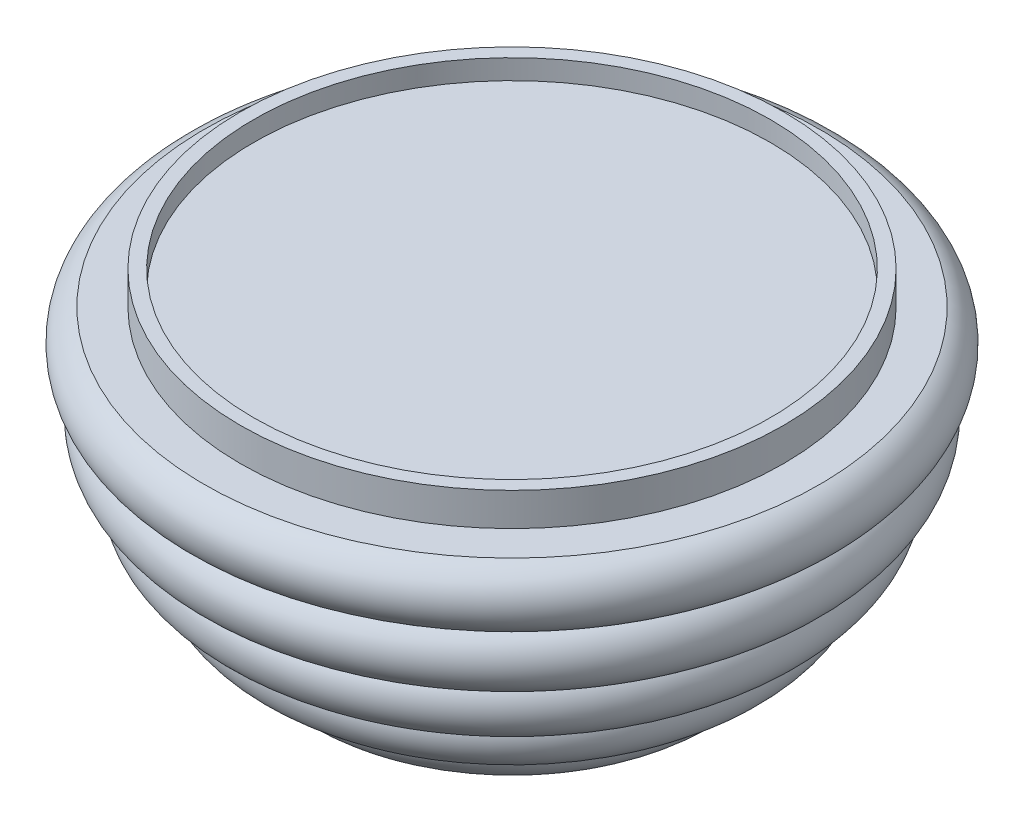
ISO-10303-21;
HEADER;
FILE_DESCRIPTION(('STEP AP214'),'2;1');
FILE_NAME('part.step','',(''),(''),'','','');
FILE_SCHEMA(('AUTOMOTIVE_DESIGN { 1 0 10303 214 1 1 1 1 }'));
ENDSEC;
DATA;
#1=APPLICATION_CONTEXT('core data for automotive mechanical design processes');
#2=APPLICATION_PROTOCOL_DEFINITION('international standard','automotive_design',2000,#1);
#3=PRODUCT_CONTEXT('',#1,'mechanical');
#4=PRODUCT('Part','Part','',(#3));
#5=PRODUCT_RELATED_PRODUCT_CATEGORY('part','',(#4));
#6=PRODUCT_DEFINITION_FORMATION('','',#4);
#7=PRODUCT_DEFINITION_CONTEXT('part definition',#1,'design');
#8=PRODUCT_DEFINITION('design','',#6,#7);
#9=PRODUCT_DEFINITION_SHAPE('','',#8);
#10=(LENGTH_UNIT() NAMED_UNIT(*) SI_UNIT(.MILLI.,.METRE.));
#11=(NAMED_UNIT(*) PLANE_ANGLE_UNIT() SI_UNIT($,.RADIAN.));
#12=(NAMED_UNIT(*) SI_UNIT($,.STERADIAN.) SOLID_ANGLE_UNIT());
#13=UNCERTAINTY_MEASURE_WITH_UNIT(LENGTH_MEASURE(1.E-05),#10,'distance_accuracy_value','');
#14=(GEOMETRIC_REPRESENTATION_CONTEXT(3) GLOBAL_UNCERTAINTY_ASSIGNED_CONTEXT((#13)) GLOBAL_UNIT_ASSIGNED_CONTEXT((#10,
#11,#12)) REPRESENTATION_CONTEXT('',''));
#15=CARTESIAN_POINT('',(0.,0.,0.));
#16=DIRECTION('',(0.,0.,1.));
#17=DIRECTION('',(1.,0.,0.));
#18=AXIS2_PLACEMENT_3D('',#15,#16,#17);
#19=CARTESIAN_POINT('',(0.451210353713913,-2.80081885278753,107.177128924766));
#20=DIRECTION('',(0.,-1.,0.));
#21=DIRECTION('',(0.,0.,-1.));
#22=AXIS2_PLACEMENT_3D('',#19,#20,#21);
#23=CYLINDRICAL_SURFACE('',#22,41.);
#24=CARTESIAN_POINT('',(0.451210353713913,-2.80081885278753,107.177128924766));
#25=DIRECTION('',(0.,1.,0.));
#26=DIRECTION('',(0.,0.,1.));
#27=AXIS2_PLACEMENT_3D('',#24,#25,#26);
#28=CIRCLE('',#27,41.);
#29=CARTESIAN_POINT('',(0.451210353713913,-2.80081885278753,148.177128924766));
#30=VERTEX_POINT('',#29);
#31=EDGE_CURVE('P0_E10',#30,#30,#28,.T.);
#32=ORIENTED_EDGE('',*,*,#31,.F.);
#33=EDGE_LOOP('',(#32));
#34=FACE_BOUND('',#33,.T.);
#35=CARTESIAN_POINT('',(0.451210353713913,-7.80081885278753,107.177128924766));
#36=DIRECTION('',(0.,1.,0.));
#37=DIRECTION('',(0.,0.,1.));
#38=AXIS2_PLACEMENT_3D('',#35,#36,#37);
#39=CIRCLE('',#38,41.);
#40=CARTESIAN_POINT('',(0.451210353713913,-7.80081885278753,148.177128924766));
#41=VERTEX_POINT('',#40);
#42=EDGE_CURVE('P0_E18',#41,#41,#39,.T.);
#43=ORIENTED_EDGE('',*,*,#42,.T.);
#44=EDGE_LOOP('',(#43));
#45=FACE_BOUND('',#44,.T.);
#46=ADVANCED_FACE('P0_F15',(#34,#45),#23,.T.);
#47=CARTESIAN_POINT('',(0.451210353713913,-2.80081885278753,107.177128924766));
#48=DIRECTION('',(0.,1.,0.));
#49=DIRECTION('',(0.,0.,1.));
#50=AXIS2_PLACEMENT_3D('',#47,#48,#49);
#51=PLANE('',#50);
#52=CARTESIAN_POINT('',(0.451210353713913,-2.80081885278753,107.177128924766));
#53=DIRECTION('',(0.,1.,0.));
#54=DIRECTION('',(0.,0.,1.));
#55=AXIS2_PLACEMENT_3D('',#52,#53,#54);
#56=CIRCLE('',#55,39.);
#57=CARTESIAN_POINT('',(0.451210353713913,-2.80081885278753,146.177128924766));
#58=VERTEX_POINT('',#57);
#59=EDGE_CURVE('P0_E25',#58,#58,#56,.T.);
#60=ORIENTED_EDGE('',*,*,#59,.F.);
#61=EDGE_LOOP('',(#60));
#62=FACE_BOUND('',#61,.T.);
#63=ORIENTED_EDGE('',*,*,#31,.T.);
#64=EDGE_LOOP('',(#63));
#65=FACE_BOUND('',#64,.T.);
#66=ADVANCED_FACE('P0_F46',(#62,#65),#51,.T.);
#67=CARTESIAN_POINT('',(0.451210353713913,-7.80081885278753,107.177128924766));
#68=DIRECTION('',(0.,1.,0.));
#69=DIRECTION('',(0.,0.,1.));
#70=AXIS2_PLACEMENT_3D('',#67,#68,#69);
#71=PLANE('',#70);
#72=ORIENTED_EDGE('',*,*,#42,.F.);
#73=EDGE_LOOP('',(#72));
#74=FACE_BOUND('',#73,.T.);
#75=ADVANCED_FACE('P0_F37',(#74),#71,.F.);
#76=CARTESIAN_POINT('',(0.451210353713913,-2.80081885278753,107.177128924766));
#77=DIRECTION('',(0.,-1.,0.));
#78=DIRECTION('',(0.,0.,-1.));
#79=AXIS2_PLACEMENT_3D('',#76,#77,#78);
#80=CYLINDRICAL_SURFACE('',#79,39.);
#81=ORIENTED_EDGE('',*,*,#59,.T.);
#82=EDGE_LOOP('',(#81));
#83=FACE_BOUND('',#82,.T.);
#84=CARTESIAN_POINT('',(0.451210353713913,-5.80081885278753,107.177128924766));
#85=DIRECTION('',(0.,1.,0.));
#86=DIRECTION('',(0.,0.,1.));
#87=AXIS2_PLACEMENT_3D('',#84,#85,#86);
#88=CIRCLE('',#87,39.);
#89=CARTESIAN_POINT('',(0.451210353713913,-5.80081885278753,146.177128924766));
#90=VERTEX_POINT('',#89);
#91=EDGE_CURVE('P0_E29',#90,#90,#88,.T.);
#92=ORIENTED_EDGE('',*,*,#91,.F.);
#93=EDGE_LOOP('',(#92));
#94=FACE_BOUND('',#93,.T.);
#95=ADVANCED_FACE('P0_F35',(#83,#94),#80,.F.);
#96=CARTESIAN_POINT('',(0.451210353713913,-5.80081885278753,107.177128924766));
#97=DIRECTION('',(0.,1.,0.));
#98=DIRECTION('',(0.,0.,1.));
#99=AXIS2_PLACEMENT_3D('',#96,#97,#98);
#100=PLANE('',#99);
#101=ORIENTED_EDGE('',*,*,#91,.T.);
#102=EDGE_LOOP('',(#101));
#103=FACE_BOUND('',#102,.T.);
#104=ADVANCED_FACE('P0_F33',(#103),#100,.T.);
#105=CLOSED_SHELL('',(#46,#66,#75,#95,#104));
#106=MANIFOLD_SOLID_BREP('P0_B1',#105);
#107=CARTESIAN_POINT('',(0.451210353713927,-52.8008188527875,107.177128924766));
#108=DIRECTION('',(0.,1.,0.));
#109=DIRECTION('',(-0.995644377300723,0.,-0.093232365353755));
#110=AXIS2_PLACEMENT_3D('',#107,#108,#109);
#111=SPHERICAL_SURFACE('',#110,5.);
#112=CARTESIAN_POINT('',(0.451210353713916,-53.9952712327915,107.177128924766));
#113=DIRECTION('',(0.,1.,0.));
#114=DIRECTION('',(-0.093232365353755,0.,0.995644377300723));
#115=AXIS2_PLACEMENT_3D('',#112,#113,#114);
#116=CIRCLE('',#115,4.85523259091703);
#117=CARTESIAN_POINT('',(-0.0014544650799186,-53.9952712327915,112.0112139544));
#118=VERTEX_POINT('',#117);
#119=EDGE_CURVE('P1_E39',#118,#118,#116,.T.);
#120=ORIENTED_EDGE('',*,*,#119,.F.);
#121=EDGE_LOOP('',(#120));
#122=FACE_BOUND('',#121,.T.);
#123=ADVANCED_FACE('P1_F14',(#122),#111,.T.);
#124=CARTESIAN_POINT('',(0.451210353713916,-12.5045996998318,107.177128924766));
#125=DIRECTION('',(0.,1.,0.));
#126=DIRECTION('',(-0.093232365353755,0.,0.995644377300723));
#127=AXIS2_PLACEMENT_3D('',#124,#125,#126);
#128=TOROIDAL_SURFACE('',#127,44.7534852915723,5.);
#129=CARTESIAN_POINT('',(0.451210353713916,-17.4580890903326,107.177128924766));
#130=DIRECTION('',(0.,1.,0.));
#131=DIRECTION('',(-0.093232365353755,0.,0.995644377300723));
#132=AXIS2_PLACEMENT_3D('',#129,#130,#131);
#133=CIRCLE('',#132,45.4338843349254);
#134=CARTESIAN_POINT('',(-3.7846981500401,-17.4580890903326,152.413120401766));
#135=VERTEX_POINT('',#134);
#136=EDGE_CURVE('P1_E9',#135,#135,#133,.T.);
#137=ORIENTED_EDGE('',*,*,#136,.T.);
#138=EDGE_LOOP('',(#137));
#139=FACE_BOUND('',#138,.T.);
#140=CARTESIAN_POINT('',(0.451210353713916,-7.80081885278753,107.177128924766));
#141=DIRECTION('',(0.,-1.,0.));
#142=DIRECTION('',(0.093232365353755,0.,-0.995644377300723));
#143=AXIS2_PLACEMENT_3D('',#140,#141,#142);
#144=CIRCLE('',#143,46.4489043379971);
#145=CARTESIAN_POINT('',(4.78175157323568,-7.80081885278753,60.9305384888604));
#146=VERTEX_POINT('',#145);
#147=EDGE_CURVE('P1_E42',#146,#146,#144,.F.);
#148=ORIENTED_EDGE('',*,*,#147,.F.);
#149=EDGE_LOOP('',(#148));
#150=FACE_BOUND('',#149,.T.);
#151=ADVANCED_FACE('P1_F85',(#139,#150),#128,.T.);
#152=CARTESIAN_POINT('',(0.451210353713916,-21.70658359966,107.177128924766));
#153=DIRECTION('',(0.,1.,0.));
#154=DIRECTION('',(-0.093232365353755,0.,0.995644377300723));
#155=AXIS2_PLACEMENT_3D('',#152,#153,#154);
#156=TOROIDAL_SURFACE('',#155,42.797543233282,4.99999999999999);
#157=CARTESIAN_POINT('',(0.451210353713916,-26.6932902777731,107.177128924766));
#158=DIRECTION('',(0.,1.,0.));
#159=DIRECTION('',(-0.093232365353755,0.,0.995644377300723));
#160=AXIS2_PLACEMENT_3D('',#157,#158,#159);
#161=CIRCLE('',#160,42.4331855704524);
#162=CARTESIAN_POINT('',(-3.50493590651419,-26.6932902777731,149.425491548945));
#163=VERTEX_POINT('',#162);
#164=EDGE_CURVE('P1_E20',#163,#163,#161,.T.);
#165=ORIENTED_EDGE('',*,*,#164,.T.);
#166=EDGE_LOOP('',(#165));
#167=FACE_BOUND('',#166,.T.);
#168=ORIENTED_EDGE('',*,*,#136,.F.);
#169=EDGE_LOOP('',(#168));
#170=FACE_BOUND('',#169,.T.);
#171=ADVANCED_FACE('P1_F87',(#167,#170),#156,.T.);
#172=CARTESIAN_POINT('',(0.451210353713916,-30.3008188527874,107.177128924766));
#173=DIRECTION('',(0.,1.,0.));
#174=DIRECTION('',(-0.093232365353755,0.,0.995644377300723));
#175=AXIS2_PLACEMENT_3D('',#172,#173,#174);
#176=TOROIDAL_SURFACE('',#175,38.9711431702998,4.99999999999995);
#177=CARTESIAN_POINT('',(0.451210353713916,-35.1027998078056,107.177128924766));
#178=DIRECTION('',(0.,1.,0.));
#179=DIRECTION('',(-0.093232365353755,0.,0.995644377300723));
#180=AXIS2_PLACEMENT_3D('',#177,#178,#179);
#181=CIRCLE('',#180,37.5779529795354);
#182=CARTESIAN_POINT('',(-3.05227108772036,-35.1027998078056,144.591406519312));
#183=VERTEX_POINT('',#182);
#184=EDGE_CURVE('P1_E24',#183,#183,#181,.T.);
#185=ORIENTED_EDGE('',*,*,#184,.T.);
#186=EDGE_LOOP('',(#185));
#187=FACE_BOUND('',#186,.T.);
#188=ORIENTED_EDGE('',*,*,#164,.F.);
#189=EDGE_LOOP('',(#188));
#190=FACE_BOUND('',#189,.T.);
#191=ADVANCED_FACE('P1_F93',(#187,#190),#176,.T.);
#192=CARTESIAN_POINT('',(0.451210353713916,-37.9116961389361,107.177128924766));
#193=DIRECTION('',(0.,1.,0.));
#194=DIRECTION('',(-0.093232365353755,0.,0.995644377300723));
#195=AXIS2_PLACEMENT_3D('',#192,#193,#194);
#196=TOROIDAL_SURFACE('',#195,33.4415171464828,4.99999999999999);
#197=CARTESIAN_POINT('',(0.451210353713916,-42.3190817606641,107.177128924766));
#198=DIRECTION('',(0.,1.,0.));
#199=DIRECTION('',(-0.093232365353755,0.,0.995644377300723));
#200=AXIS2_PLACEMENT_3D('',#197,#198,#199);
#201=CIRCLE('',#200,31.0803835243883);
#202=CARTESIAN_POINT('',(-2.44648731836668,-42.3190817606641,138.122138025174));
#203=VERTEX_POINT('',#202);
#204=EDGE_CURVE('P1_E28',#203,#203,#201,.T.);
#205=ORIENTED_EDGE('',*,*,#204,.T.);
#206=EDGE_LOOP('',(#205));
#207=FACE_BOUND('',#206,.T.);
#208=ORIENTED_EDGE('',*,*,#184,.F.);
#209=EDGE_LOOP('',(#208));
#210=FACE_BOUND('',#209,.T.);
#211=ADVANCED_FACE('P1_F99',(#207,#210),#196,.T.);
#212=CARTESIAN_POINT('',(0.451210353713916,-44.2065835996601,107.177128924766));
#213=DIRECTION('',(0.,1.,0.));
#214=DIRECTION('',(-0.093232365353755,0.,0.995644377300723));
#215=AXIS2_PLACEMENT_3D('',#212,#213,#214);
#216=TOROIDAL_SURFACE('',#215,26.4503363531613,5.);
#217=CARTESIAN_POINT('',(0.451210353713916,-48.0267499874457,107.177128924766));
#218=DIRECTION('',(0.,1.,0.));
#219=DIRECTION('',(-0.093232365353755,0.,0.995644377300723));
#220=AXIS2_PLACEMENT_3D('',#217,#218,#219);
#221=CIRCLE('',#220,23.2244521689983);
#222=CARTESIAN_POINT('',(-1.71406025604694,-48.0267499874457,130.300424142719));
#223=VERTEX_POINT('',#222);
#224=EDGE_CURVE('P1_E33',#223,#223,#221,.T.);
#225=ORIENTED_EDGE('',*,*,#224,.T.);
#226=EDGE_LOOP('',(#225));
#227=FACE_BOUND('',#226,.T.);
#228=ORIENTED_EDGE('',*,*,#204,.F.);
#229=EDGE_LOOP('',(#228));
#230=FACE_BOUND('',#229,.T.);
#231=ADVANCED_FACE('P1_F103',(#227,#230),#216,.T.);
#232=CARTESIAN_POINT('',(0.451210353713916,-48.9103644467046,107.177128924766));
#233=DIRECTION('',(0.,1.,0.));
#234=DIRECTION('',(-0.093232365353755,0.,0.995644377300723));
#235=AXIS2_PLACEMENT_3D('',#232,#233,#234);
#236=TOROIDAL_SURFACE('',#235,18.303148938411,5.);
#237=CARTESIAN_POINT('',(0.451210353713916,-51.9763519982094,107.177128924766));
#238=DIRECTION('',(0.,1.,0.));
#239=DIRECTION('',(-0.093232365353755,0.,0.995644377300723));
#240=AXIS2_PLACEMENT_3D('',#237,#238,#239);
#241=CIRCLE('',#240,14.3535008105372);
#242=CARTESIAN_POINT('',(-0.887000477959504,-51.9763519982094,121.468111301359));
#243=VERTEX_POINT('',#242);
#244=EDGE_CURVE('P1_E36',#243,#243,#241,.T.);
#245=ORIENTED_EDGE('',*,*,#244,.T.);
#246=EDGE_LOOP('',(#245));
#247=FACE_BOUND('',#246,.T.);
#248=ORIENTED_EDGE('',*,*,#224,.F.);
#249=EDGE_LOOP('',(#248));
#250=FACE_BOUND('',#249,.T.);
#251=ADVANCED_FACE('P1_F107',(#247,#250),#236,.T.);
#252=CARTESIAN_POINT('',(0.451210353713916,-51.8174608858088,107.177128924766));
#253=DIRECTION('',(0.,1.,0.));
#254=DIRECTION('',(-0.093232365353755,0.,0.995644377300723));
#255=AXIS2_PLACEMENT_3D('',#252,#253,#254);
#256=TOROIDAL_SURFACE('',#255,9.35602608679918,5.);
#257=ORIENTED_EDGE('',*,*,#119,.T.);
#258=EDGE_LOOP('',(#257));
#259=FACE_BOUND('',#258,.T.);
#260=ORIENTED_EDGE('',*,*,#244,.F.);
#261=EDGE_LOOP('',(#260));
#262=FACE_BOUND('',#261,.T.);
#263=ADVANCED_FACE('P1_F81',(#259,#262),#256,.T.);
#264=CARTESIAN_POINT('',(-53.7574229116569,-7.80081885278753,21.7510460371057));
#265=DIRECTION('',(0.,-1.,0.));
#266=DIRECTION('',(0.093232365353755,0.,-0.995644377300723));
#267=AXIS2_PLACEMENT_3D('',#264,#265,#266);
#268=PLANE('',#267);
#269=CARTESIAN_POINT('',(0.451210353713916,-7.80081885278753,107.177128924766));
#270=DIRECTION('',(0.,1.,0.));
#271=DIRECTION('',(-0.093232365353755,0.,0.995644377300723));
#272=AXIS2_PLACEMENT_3D('',#269,#270,#271);
#273=CIRCLE('',#272,12.5);
#274=CARTESIAN_POINT('',(-0.714194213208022,-7.80081885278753,119.622683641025));
#275=VERTEX_POINT('',#274);
#276=EDGE_CURVE('P1_E46',#275,#275,#273,.T.);
#277=ORIENTED_EDGE('',*,*,#276,.F.);
#278=EDGE_LOOP('',(#277));
#279=FACE_BOUND('',#278,.T.);
#280=ORIENTED_EDGE('',*,*,#147,.T.);
#281=EDGE_LOOP('',(#280));
#282=FACE_BOUND('',#281,.T.);
#283=ADVANCED_FACE('P1_F75',(#279,#282),#268,.F.);
#284=CARTESIAN_POINT('',(0.451210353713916,-10.8008188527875,107.177128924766));
#285=DIRECTION('',(0.,1.,0.));
#286=DIRECTION('',(-0.093232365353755,0.,0.995644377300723));
#287=AXIS2_PLACEMENT_3D('',#284,#285,#286);
#288=CYLINDRICAL_SURFACE('',#287,12.5);
#289=CARTESIAN_POINT('',(0.451210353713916,-10.8008188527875,107.177128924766));
#290=DIRECTION('',(0.,1.,0.));
#291=DIRECTION('',(-0.093232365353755,0.,0.995644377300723));
#292=AXIS2_PLACEMENT_3D('',#289,#290,#291);
#293=CIRCLE('',#292,12.5);
#294=CARTESIAN_POINT('',(-0.714194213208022,-10.8008188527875,119.622683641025));
#295=VERTEX_POINT('',#294);
#296=EDGE_CURVE('P1_E45',#295,#295,#293,.T.);
#297=ORIENTED_EDGE('',*,*,#296,.F.);
#298=EDGE_LOOP('',(#297));
#299=FACE_BOUND('',#298,.T.);
#300=ORIENTED_EDGE('',*,*,#276,.T.);
#301=EDGE_LOOP('',(#300));
#302=FACE_BOUND('',#301,.T.);
#303=ADVANCED_FACE('P1_F69',(#299,#302),#288,.F.);
#304=CARTESIAN_POINT('',(0.451210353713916,-10.8008188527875,107.177128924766));
#305=DIRECTION('',(0.,1.,0.));
#306=DIRECTION('',(-0.093232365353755,0.,0.995644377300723));
#307=AXIS2_PLACEMENT_3D('',#304,#305,#306);
#308=PLANE('',#307);
#309=CARTESIAN_POINT('',(0.451210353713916,-10.8008188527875,107.177128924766));
#310=DIRECTION('',(0.,1.,0.));
#311=DIRECTION('',(-0.093232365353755,0.,0.995644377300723));
#312=AXIS2_PLACEMENT_3D('',#309,#310,#311);
#313=CIRCLE('',#312,11.);
#314=CARTESIAN_POINT('',(-0.574345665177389,-10.8008188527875,118.129217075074));
#315=VERTEX_POINT('',#314);
#316=EDGE_CURVE('P1_E52',#315,#315,#313,.T.);
#317=ORIENTED_EDGE('',*,*,#316,.F.);
#318=EDGE_LOOP('',(#317));
#319=FACE_BOUND('',#318,.T.);
#320=ORIENTED_EDGE('',*,*,#296,.T.);
#321=EDGE_LOOP('',(#320));
#322=FACE_BOUND('',#321,.T.);
#323=ADVANCED_FACE('P1_F63',(#319,#322),#308,.T.);
#324=CARTESIAN_POINT('',(0.451210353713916,-45.8008188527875,107.177128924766));
#325=DIRECTION('',(0.,1.,0.));
#326=DIRECTION('',(-0.093232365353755,0.,0.995644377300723));
#327=AXIS2_PLACEMENT_3D('',#324,#325,#326);
#328=CYLINDRICAL_SURFACE('',#327,11.);
#329=CARTESIAN_POINT('',(0.451210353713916,-45.8008188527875,107.177128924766));
#330=DIRECTION('',(0.,1.,0.));
#331=DIRECTION('',(-0.093232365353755,0.,0.995644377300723));
#332=AXIS2_PLACEMENT_3D('',#329,#330,#331);
#333=CIRCLE('',#332,11.);
#334=CARTESIAN_POINT('',(-0.574345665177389,-45.8008188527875,118.129217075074));
#335=VERTEX_POINT('',#334);
#336=EDGE_CURVE('P1_E49',#335,#335,#333,.T.);
#337=ORIENTED_EDGE('',*,*,#336,.F.);
#338=EDGE_LOOP('',(#337));
#339=FACE_BOUND('',#338,.T.);
#340=ORIENTED_EDGE('',*,*,#316,.T.);
#341=EDGE_LOOP('',(#340));
#342=FACE_BOUND('',#341,.T.);
#343=ADVANCED_FACE('P1_F60',(#339,#342),#328,.F.);
#344=CARTESIAN_POINT('',(0.451210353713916,-45.8008188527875,107.177128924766));
#345=DIRECTION('',(0.,1.,0.));
#346=DIRECTION('',(-0.093232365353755,0.,0.995644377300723));
#347=AXIS2_PLACEMENT_3D('',#344,#345,#346);
#348=PLANE('',#347);
#349=ORIENTED_EDGE('',*,*,#336,.T.);
#350=EDGE_LOOP('',(#349));
#351=FACE_BOUND('',#350,.T.);
#352=ADVANCED_FACE('P1_F58',(#351),#348,.T.);
#353=CLOSED_SHELL('',(#123,#151,#171,#191,#211,#231,#251,#263,#283,#303,#323,#343,#352));
#354=MANIFOLD_SOLID_BREP('P1_B1',#353);
#355=ADVANCED_BREP_SHAPE_REPRESENTATION('',(#18,#106,#354),#14);
#356=SHAPE_DEFINITION_REPRESENTATION(#9,#355);
ENDSEC;
END-ISO-10303-21;
